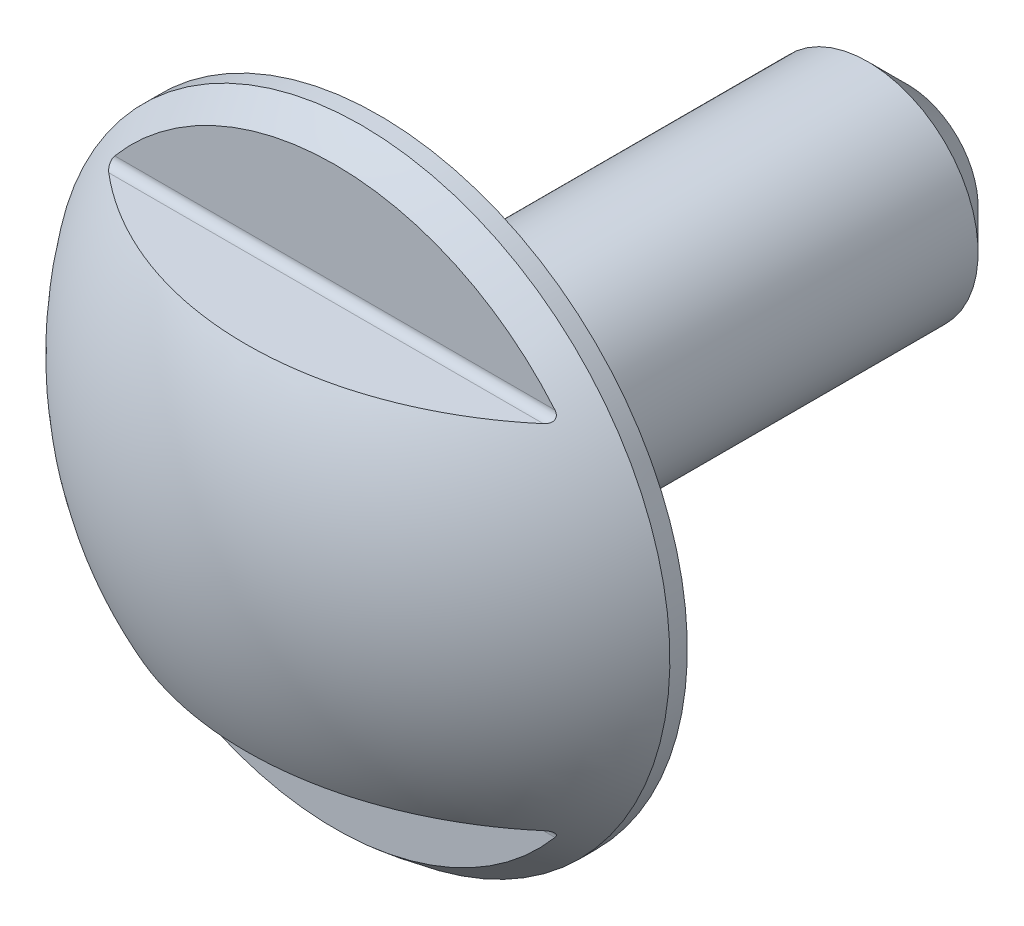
ISO-10303-21;
HEADER;
FILE_DESCRIPTION(('STEP AP214'),'2;1');
FILE_NAME('part.step','',(''),(''),'','','');
FILE_SCHEMA(('AUTOMOTIVE_DESIGN { 1 0 10303 214 1 1 1 1 }'));
ENDSEC;
DATA;
#1=APPLICATION_CONTEXT('core data for automotive mechanical design processes');
#2=APPLICATION_PROTOCOL_DEFINITION('international standard','automotive_design',2000,#1);
#3=PRODUCT_CONTEXT('',#1,'mechanical');
#4=PRODUCT('Part','Part','',(#3));
#5=PRODUCT_RELATED_PRODUCT_CATEGORY('part','',(#4));
#6=PRODUCT_DEFINITION_FORMATION('','',#4);
#7=PRODUCT_DEFINITION_CONTEXT('part definition',#1,'design');
#8=PRODUCT_DEFINITION('design','',#6,#7);
#9=PRODUCT_DEFINITION_SHAPE('','',#8);
#10=(LENGTH_UNIT() NAMED_UNIT(*) SI_UNIT(.MILLI.,.METRE.));
#11=(NAMED_UNIT(*) PLANE_ANGLE_UNIT() SI_UNIT($,.RADIAN.));
#12=(NAMED_UNIT(*) SI_UNIT($,.STERADIAN.) SOLID_ANGLE_UNIT());
#13=UNCERTAINTY_MEASURE_WITH_UNIT(LENGTH_MEASURE(1.E-05),#10,'distance_accuracy_value','');
#14=(GEOMETRIC_REPRESENTATION_CONTEXT(3) GLOBAL_UNCERTAINTY_ASSIGNED_CONTEXT((#13)) GLOBAL_UNIT_ASSIGNED_CONTEXT((#10,
#11,#12)) REPRESENTATION_CONTEXT('',''));
#15=CARTESIAN_POINT('',(0.,0.,0.));
#16=DIRECTION('',(0.,0.,1.));
#17=DIRECTION('',(1.,0.,0.));
#18=AXIS2_PLACEMENT_3D('',#15,#16,#17);
#19=CARTESIAN_POINT('',(0.,0.,-4.6));
#20=DIRECTION('',(0.,0.,-1.));
#21=DIRECTION('',(0.,1.,0.));
#22=AXIS2_PLACEMENT_3D('',#19,#20,#21);
#23=SPHERICAL_SURFACE('',#22,8.6);
#24=CARTESIAN_POINT('',(-4.93129589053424,4.00000010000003,1.2002));
#25=CARTESIAN_POINT('',(-4.94400869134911,4.00002755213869,1.18937440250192));
#26=CARTESIAN_POINT('',(-4.95653273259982,4.00086569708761,1.17807442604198));
#27=CARTESIAN_POINT('',(-4.98061859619,4.00484818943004,1.15455617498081));
#28=CARTESIAN_POINT('',(-4.99216373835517,4.00802596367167,1.14232691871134));
#29=CARTESIAN_POINT('',(-5.00824851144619,4.01517073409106,1.12327969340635));
#30=CARTESIAN_POINT('',(-5.01350134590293,4.01803673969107,1.11666550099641));
#31=CARTESIAN_POINT('',(-5.02325352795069,4.02472778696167,1.10338223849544));
#32=CARTESIAN_POINT('',(-5.02775470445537,4.02855044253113,1.09671334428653));
#33=CARTESIAN_POINT('',(-5.03581444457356,4.03733580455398,1.08335937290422));
#34=CARTESIAN_POINT('',(-5.03935808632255,4.04231453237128,1.07667551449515));
#35=CARTESIAN_POINT('',(-5.04506912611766,4.05341379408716,1.06367327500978));
#36=CARTESIAN_POINT('',(-5.04723943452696,4.05953187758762,1.05735414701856));
#37=CARTESIAN_POINT('',(-5.04972761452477,4.07179152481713,1.04631064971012));
#38=CARTESIAN_POINT('',(-5.05027001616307,4.07779874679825,1.04148821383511));
#39=CARTESIAN_POINT('',(-5.05008675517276,4.09031918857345,1.03258125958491));
#40=CARTESIAN_POINT('',(-5.04936142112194,4.09683227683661,1.02849655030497));
#41=CARTESIAN_POINT('',(-5.04692396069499,4.10910465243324,1.02173108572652));
#42=CARTESIAN_POINT('',(-5.04537374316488,4.11483286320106,1.01893202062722));
#43=CARTESIAN_POINT('',(-5.04152786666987,4.12630985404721,1.0139653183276));
#44=CARTESIAN_POINT('',(-5.03923189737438,4.1320586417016,1.01179794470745));
#45=CARTESIAN_POINT('',(-5.03276073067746,4.14622406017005,1.00715966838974));
#46=CARTESIAN_POINT('',(-5.02821352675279,4.15458782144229,1.00504797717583));
#47=CARTESIAN_POINT('',(-5.01813792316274,4.17091578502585,1.00195038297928));
#48=CARTESIAN_POINT('',(-5.01260774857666,4.1788792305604,1.00096654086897));
#49=CARTESIAN_POINT('',(-5.00321047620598,4.19122344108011,1.00013972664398));
#50=CARTESIAN_POINT('',(-4.99956818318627,4.19575786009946,0.99999715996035));
#51=CARTESIAN_POINT('',(-4.99583014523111,4.2002,1.0000001));
#52=B_SPLINE_CURVE_WITH_KNOTS('',3,(#24,#25,#26,#27,#28,#29,#30,#31,#32,#33,#34,#35,#36,#37,#38,
#39,#40,#41,#42,#43,#44,#45,#46,#47,#48,#49,#50,#51),.UNSPECIFIED.,.F.,.F.,(4,2,2,2,2,2,2,2,2,2,
2,2,2,4),(0.,0.0503367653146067,0.101407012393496,0.128096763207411,0.154720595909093,
0.181738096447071,0.208698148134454,0.231714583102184,0.2547250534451,0.274330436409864,
0.293943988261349,0.323032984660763,0.35217504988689,0.369605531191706),.UNSPECIFIED.);
#53=CARTESIAN_POINT('',(-4.93153120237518,4.,1.2));
#54=VERTEX_POINT('',#53);
#55=CARTESIAN_POINT('',(-4.99599839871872,4.2,1.));
#56=VERTEX_POINT('',#55);
#57=EDGE_CURVE('E65',#54,#56,#52,.T.);
#58=ORIENTED_EDGE('',*,*,#57,.T.);
#59=CARTESIAN_POINT('',(0.,0.,1.));
#60=DIRECTION('',(0.,0.,1.));
#61=DIRECTION('',(1.,0.,0.));
#62=AXIS2_PLACEMENT_3D('',#59,#60,#61);
#63=CIRCLE('',#62,6.52686754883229);
#64=CARTESIAN_POINT('',(4.99599839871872,4.2,1.));
#65=VERTEX_POINT('',#64);
#66=EDGE_CURVE('E53',#56,#65,#63,.F.);
#67=ORIENTED_EDGE('',*,*,#66,.T.);
#68=CARTESIAN_POINT('',(4.9958301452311,4.2002,1.00000010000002));
#69=CARTESIAN_POINT('',(5.00201722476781,4.19284644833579,0.99999628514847));
#70=CARTESIAN_POINT('',(5.00795600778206,4.18522194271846,1.00039174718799));
#71=CARTESIAN_POINT('',(5.01910433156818,4.16943558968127,1.00218645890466));
#72=CARTESIAN_POINT('',(5.0243041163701,4.16126833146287,1.00359786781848));
#73=CARTESIAN_POINT('',(5.03264013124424,4.1462693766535,1.00723142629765));
#74=CARTESIAN_POINT('',(5.03598102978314,4.13950102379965,1.00923230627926));
#75=CARTESIAN_POINT('',(5.04172228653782,4.12589879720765,1.01409436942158));
#76=CARTESIAN_POINT('',(5.0441263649,4.11906529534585,1.01695206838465));
#77=CARTESIAN_POINT('',(5.04782424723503,4.10543946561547,1.02360193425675));
#78=CARTESIAN_POINT('',(5.04910502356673,4.09864850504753,1.02740442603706));
#79=CARTESIAN_POINT('',(5.05036095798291,4.08547550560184,1.03585003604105));
#80=CARTESIAN_POINT('',(5.05033629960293,4.07909340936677,1.0404930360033));
#81=CARTESIAN_POINT('',(5.04909312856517,4.06795403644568,1.04964179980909));
#82=CARTESIAN_POINT('',(5.04806155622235,4.06309863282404,1.05405587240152));
#83=CARTESIAN_POINT('',(5.04516012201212,4.05396740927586,1.06319268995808));
#84=CARTESIAN_POINT('',(5.04329002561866,4.04969175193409,1.06791552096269));
#85=CARTESIAN_POINT('',(5.0380851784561,4.04042199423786,1.07915187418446));
#86=CARTESIAN_POINT('',(5.0344694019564,4.035669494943,1.08573369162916));
#87=CARTESIAN_POINT('',(5.02626946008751,4.027215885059,1.09896713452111));
#88=CARTESIAN_POINT('',(5.0216832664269,4.02351701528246,1.10561887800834));
#89=CARTESIAN_POINT('',(5.00927696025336,4.01540744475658,1.12222215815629));
#90=CARTESIAN_POINT('',(5.00100161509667,4.01159831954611,1.13212358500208));
#91=CARTESIAN_POINT('',(4.98342713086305,4.00569831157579,1.15152293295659));
#92=CARTESIAN_POINT('',(4.97412528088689,4.00361210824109,1.16101968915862));
#93=CARTESIAN_POINT('',(4.95912315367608,4.00144679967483,1.17542874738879));
#94=CARTESIAN_POINT('',(4.95364736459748,4.00088815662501,1.18051276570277));
#95=CARTESIAN_POINT('',(4.94256715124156,4.00016429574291,1.19048969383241));
#96=CARTESIAN_POINT('',(4.93696387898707,3.99999638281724,1.19538368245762));
#97=CARTESIAN_POINT('',(4.93129589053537,4.00000009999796,1.20020000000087));
#98=B_SPLINE_CURVE_WITH_KNOTS('',3,(#68,#69,#70,#71,#72,#73,#74,#75,#76,#77,#78,#79,#80,#81,#82,
#83,#84,#85,#86,#87,#88,#89,#90,#91,#92,#93,#94,#95,#96,#97),.UNSPECIFIED.,.F.,.F.,(4,2,2,2,2,2,
2,2,2,2,2,2,2,2,4),(0.,0.0288904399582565,0.0581325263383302,0.0814696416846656,
0.104713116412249,0.128222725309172,0.1517290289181,0.171566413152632,0.191409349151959,
0.217922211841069,0.244491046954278,0.284631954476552,0.324881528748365,0.347348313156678,
0.369659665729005),.UNSPECIFIED.);
#99=CARTESIAN_POINT('',(4.93153120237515,4.,1.2));
#100=VERTEX_POINT('',#99);
#101=EDGE_CURVE('E58',#65,#100,#98,.T.);
#102=ORIENTED_EDGE('',*,*,#101,.T.);
#103=CARTESIAN_POINT('',(0.,4.,-4.6));
#104=DIRECTION('',(0.,1.,0.));
#105=DIRECTION('',(0.,0.,1.));
#106=AXIS2_PLACEMENT_3D('',#103,#104,#105);
#107=CIRCLE('',#106,7.61314652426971);
#108=EDGE_CURVE('E70',#100,#54,#107,.F.);
#109=ORIENTED_EDGE('',*,*,#108,.T.);
#110=EDGE_LOOP('',(#58,#67,#102,#109));
#111=FACE_BOUND('',#110,.T.);
#112=CARTESIAN_POINT('',(0.,0.,0.395998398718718));
#113=DIRECTION('',(0.,0.,-1.));
#114=DIRECTION('',(-1.,0.,0.));
#115=AXIS2_PLACEMENT_3D('',#112,#113,#114);
#116=CIRCLE('',#115,7.);
#117=CARTESIAN_POINT('',(-7.,0.,0.395998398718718));
#118=VERTEX_POINT('',#117);
#119=EDGE_CURVE('E59',#118,#118,#116,.T.);
#120=ORIENTED_EDGE('',*,*,#119,.F.);
#121=EDGE_LOOP('',(#120));
#122=FACE_BOUND('',#121,.T.);
#123=CARTESIAN_POINT('',(4.93129589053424,-4.00000010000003,1.2002));
#124=CARTESIAN_POINT('',(4.94400869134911,-4.00002755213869,1.18937440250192));
#125=CARTESIAN_POINT('',(4.95653273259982,-4.00086569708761,1.17807442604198));
#126=CARTESIAN_POINT('',(4.98061859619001,-4.00484818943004,1.15455617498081));
#127=CARTESIAN_POINT('',(4.99216373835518,-4.00802596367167,1.14232691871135));
#128=CARTESIAN_POINT('',(5.00824851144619,-4.01517073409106,1.12327969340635));
#129=CARTESIAN_POINT('',(5.01350134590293,-4.01803673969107,1.11666550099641));
#130=CARTESIAN_POINT('',(5.02325352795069,-4.02472778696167,1.10338223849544));
#131=CARTESIAN_POINT('',(5.02775470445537,-4.02855044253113,1.09671334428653));
#132=CARTESIAN_POINT('',(5.03581444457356,-4.03733580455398,1.08335937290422));
#133=CARTESIAN_POINT('',(5.03935808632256,-4.04231453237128,1.07667551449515));
#134=CARTESIAN_POINT('',(5.04506912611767,-4.05341379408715,1.06367327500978));
#135=CARTESIAN_POINT('',(5.04723943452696,-4.05953187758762,1.05735414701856));
#136=CARTESIAN_POINT('',(5.04972761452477,-4.07179152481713,1.04631064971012));
#137=CARTESIAN_POINT('',(5.05027001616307,-4.07779874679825,1.04148821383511));
#138=CARTESIAN_POINT('',(5.05008675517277,-4.09031918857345,1.03258125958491));
#139=CARTESIAN_POINT('',(5.04936142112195,-4.09683227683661,1.02849655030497));
#140=CARTESIAN_POINT('',(5.046923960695,-4.10910465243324,1.02173108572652));
#141=CARTESIAN_POINT('',(5.04537374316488,-4.11483286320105,1.01893202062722));
#142=CARTESIAN_POINT('',(5.04152786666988,-4.12630985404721,1.0139653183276));
#143=CARTESIAN_POINT('',(5.03923189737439,-4.1320586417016,1.01179794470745));
#144=CARTESIAN_POINT('',(5.03276073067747,-4.14622406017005,1.00715966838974));
#145=CARTESIAN_POINT('',(5.0282135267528,-4.15458782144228,1.00504797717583));
#146=CARTESIAN_POINT('',(5.01813792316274,-4.17091578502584,1.00195038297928));
#147=CARTESIAN_POINT('',(5.01260774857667,-4.17887923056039,1.00096654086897));
#148=CARTESIAN_POINT('',(5.00321047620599,-4.19122344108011,1.00013972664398));
#149=CARTESIAN_POINT('',(4.99956818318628,-4.19575786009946,0.999997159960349));
#150=CARTESIAN_POINT('',(4.99583014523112,-4.2002,1.0000001));
#151=B_SPLINE_CURVE_WITH_KNOTS('',3,(#123,#124,#125,#126,#127,#128,#129,#130,#131,#132,#133,
#134,#135,#136,#137,#138,#139,#140,#141,#142,#143,#144,#145,#146,#147,#148,#149,#150),
.UNSPECIFIED.,.F.,.F.,(4,2,2,2,2,2,2,2,2,2,2,2,2,4),(0.,0.0503367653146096,0.101407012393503,
0.128096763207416,0.154720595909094,0.181738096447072,0.208698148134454,0.231714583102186,
0.254725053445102,0.274330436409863,0.293943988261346,0.323032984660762,0.352175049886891,
0.369605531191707),.UNSPECIFIED.);
#152=CARTESIAN_POINT('',(4.93153120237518,-4.,1.2));
#153=VERTEX_POINT('',#152);
#154=CARTESIAN_POINT('',(4.99599839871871,-4.2,1.));
#155=VERTEX_POINT('',#154);
#156=EDGE_CURVE('E116',#153,#155,#151,.T.);
#157=ORIENTED_EDGE('',*,*,#156,.T.);
#158=CARTESIAN_POINT('',(0.,0.,1.));
#159=DIRECTION('',(0.,0.,1.));
#160=DIRECTION('',(1.,0.,0.));
#161=AXIS2_PLACEMENT_3D('',#158,#159,#160);
#162=CIRCLE('',#161,6.52686754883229);
#163=CARTESIAN_POINT('',(-4.99599839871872,-4.2,1.));
#164=VERTEX_POINT('',#163);
#165=EDGE_CURVE('E123',#155,#164,#162,.F.);
#166=ORIENTED_EDGE('',*,*,#165,.T.);
#167=CARTESIAN_POINT('',(-4.9958301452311,-4.2002,1.00000010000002));
#168=CARTESIAN_POINT('',(-5.00201722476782,-4.19284644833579,0.999996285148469));
#169=CARTESIAN_POINT('',(-5.00795600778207,-4.18522194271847,1.00039174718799));
#170=CARTESIAN_POINT('',(-5.01910433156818,-4.16943558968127,1.00218645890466));
#171=CARTESIAN_POINT('',(-5.0243041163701,-4.16126833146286,1.00359786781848));
#172=CARTESIAN_POINT('',(-5.03264013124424,-4.1462693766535,1.00723142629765));
#173=CARTESIAN_POINT('',(-5.03598102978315,-4.13950102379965,1.00923230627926));
#174=CARTESIAN_POINT('',(-5.04172228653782,-4.12589879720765,1.01409436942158));
#175=CARTESIAN_POINT('',(-5.0441263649,-4.11906529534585,1.01695206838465));
#176=CARTESIAN_POINT('',(-5.04782424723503,-4.10543946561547,1.02360193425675));
#177=CARTESIAN_POINT('',(-5.04910502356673,-4.09864850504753,1.02740442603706));
#178=CARTESIAN_POINT('',(-5.05036095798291,-4.08547550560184,1.03585003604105));
#179=CARTESIAN_POINT('',(-5.05033629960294,-4.07909340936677,1.0404930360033));
#180=CARTESIAN_POINT('',(-5.04909312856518,-4.06795403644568,1.04964179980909));
#181=CARTESIAN_POINT('',(-5.04806155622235,-4.06309863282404,1.05405587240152));
#182=CARTESIAN_POINT('',(-5.04516012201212,-4.05396740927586,1.06319268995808));
#183=CARTESIAN_POINT('',(-5.04329002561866,-4.04969175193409,1.06791552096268));
#184=CARTESIAN_POINT('',(-5.0380851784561,-4.04042199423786,1.07915187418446));
#185=CARTESIAN_POINT('',(-5.03446940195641,-4.035669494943,1.08573369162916));
#186=CARTESIAN_POINT('',(-5.02626946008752,-4.027215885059,1.09896713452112));
#187=CARTESIAN_POINT('',(-5.02168326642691,-4.02351701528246,1.10561887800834));
#188=CARTESIAN_POINT('',(-5.00927696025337,-4.01540744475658,1.12222215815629));
#189=CARTESIAN_POINT('',(-5.00100161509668,-4.01159831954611,1.13212358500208));
#190=CARTESIAN_POINT('',(-4.98342713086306,-4.00569831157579,1.15152293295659));
#191=CARTESIAN_POINT('',(-4.97412528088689,-4.00361210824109,1.16101968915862));
#192=CARTESIAN_POINT('',(-4.95912315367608,-4.00144679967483,1.17542874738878));
#193=CARTESIAN_POINT('',(-4.95364736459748,-4.00088815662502,1.18051276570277));
#194=CARTESIAN_POINT('',(-4.94256715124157,-4.00016429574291,1.19048969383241));
#195=CARTESIAN_POINT('',(-4.93696387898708,-3.99999638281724,1.19538368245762));
#196=CARTESIAN_POINT('',(-4.93129589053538,-4.00000009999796,1.20020000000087));
#197=B_SPLINE_CURVE_WITH_KNOTS('',3,(#167,#168,#169,#170,#171,#172,#173,#174,#175,#176,#177,
#178,#179,#180,#181,#182,#183,#184,#185,#186,#187,#188,#189,#190,#191,#192,#193,#194,#195,#196),
.UNSPECIFIED.,.F.,.F.,(4,2,2,2,2,2,2,2,2,2,2,2,2,2,4),(0.,0.02889043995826,0.0581325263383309,
0.0814696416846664,0.10471311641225,0.128222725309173,0.151729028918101,0.171566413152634,
0.191409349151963,0.217922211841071,0.244491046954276,0.284631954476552,0.324881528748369,
0.347348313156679,0.369659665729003),.UNSPECIFIED.);
#198=CARTESIAN_POINT('',(-4.93153120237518,-4.,1.2));
#199=VERTEX_POINT('',#198);
#200=EDGE_CURVE('E110',#164,#199,#197,.T.);
#201=ORIENTED_EDGE('',*,*,#200,.T.);
#202=CARTESIAN_POINT('',(0.,-4.,-4.6));
#203=DIRECTION('',(0.,-1.,0.));
#204=DIRECTION('',(0.,0.,-1.));
#205=AXIS2_PLACEMENT_3D('',#202,#203,#204);
#206=CIRCLE('',#205,7.61314652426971);
#207=EDGE_CURVE('E72',#199,#153,#206,.F.);
#208=ORIENTED_EDGE('',*,*,#207,.T.);
#209=EDGE_LOOP('',(#157,#166,#201,#208));
#210=FACE_BOUND('',#209,.T.);
#211=ADVANCED_FACE('F14',(#111,#122,#210),#23,.T.);
#212=CARTESIAN_POINT('',(0.,0.,-10.));
#213=DIRECTION('',(0.,0.,-1.));
#214=DIRECTION('',(-1.,0.,0.));
#215=AXIS2_PLACEMENT_3D('',#212,#213,#214);
#216=CYLINDRICAL_SURFACE('',#215,7.);
#217=CARTESIAN_POINT('',(0.,0.,0.));
#218=DIRECTION('',(0.,0.,-1.));
#219=DIRECTION('',(-1.,0.,0.));
#220=AXIS2_PLACEMENT_3D('',#217,#218,#219);
#221=CIRCLE('',#220,7.);
#222=CARTESIAN_POINT('',(-7.,0.,0.));
#223=VERTEX_POINT('',#222);
#224=EDGE_CURVE('E194',#223,#223,#221,.T.);
#225=ORIENTED_EDGE('',*,*,#224,.F.);
#226=EDGE_LOOP('',(#225));
#227=FACE_BOUND('',#226,.T.);
#228=ORIENTED_EDGE('',*,*,#119,.T.);
#229=EDGE_LOOP('',(#228));
#230=FACE_BOUND('',#229,.T.);
#231=ADVANCED_FACE('F137',(#227,#230),#216,.T.);
#232=CARTESIAN_POINT('',(0.,7.,0.));
#233=DIRECTION('',(0.,0.,1.));
#234=DIRECTION('',(1.,0.,0.));
#235=AXIS2_PLACEMENT_3D('',#232,#233,#234);
#236=PLANE('',#235);
#237=CARTESIAN_POINT('',(0.,0.,0.));
#238=DIRECTION('',(0.,0.,-1.));
#239=DIRECTION('',(-1.,0.,0.));
#240=AXIS2_PLACEMENT_3D('',#237,#238,#239);
#241=CIRCLE('',#240,2.25);
#242=CARTESIAN_POINT('',(-2.25,0.,0.));
#243=VERTEX_POINT('',#242);
#244=EDGE_CURVE('E191',#243,#243,#241,.T.);
#245=ORIENTED_EDGE('',*,*,#244,.F.);
#246=EDGE_LOOP('',(#245));
#247=FACE_BOUND('',#246,.T.);
#248=ORIENTED_EDGE('',*,*,#224,.T.);
#249=EDGE_LOOP('',(#248));
#250=FACE_BOUND('',#249,.T.);
#251=ADVANCED_FACE('F141',(#247,#250),#236,.F.);
#252=CARTESIAN_POINT('',(0.,0.,-0.4));
#253=DIRECTION('',(0.,0.,-1.));
#254=DIRECTION('',(-1.,0.,0.));
#255=AXIS2_PLACEMENT_3D('',#252,#253,#254);
#256=TOROIDAL_SURFACE('',#255,2.25,0.4);
#257=CARTESIAN_POINT('',(0.,0.,-0.4));
#258=DIRECTION('',(0.,0.,-1.));
#259=DIRECTION('',(-1.,0.,0.));
#260=AXIS2_PLACEMENT_3D('',#257,#258,#259);
#261=CIRCLE('',#260,1.85);
#262=CARTESIAN_POINT('',(-1.85,0.,-0.4));
#263=VERTEX_POINT('',#262);
#264=EDGE_CURVE('E188',#263,#263,#261,.T.);
#265=ORIENTED_EDGE('',*,*,#264,.F.);
#266=EDGE_LOOP('',(#265));
#267=FACE_BOUND('',#266,.T.);
#268=ORIENTED_EDGE('',*,*,#244,.T.);
#269=EDGE_LOOP('',(#268));
#270=FACE_BOUND('',#269,.T.);
#271=ADVANCED_FACE('F146',(#267,#270),#256,.F.);
#272=CARTESIAN_POINT('',(0.,0.,-10.));
#273=DIRECTION('',(0.,0.,-1.));
#274=DIRECTION('',(-1.,0.,0.));
#275=AXIS2_PLACEMENT_3D('',#272,#273,#274);
#276=CYLINDRICAL_SURFACE('',#275,1.85);
#277=CARTESIAN_POINT('',(0.,0.,-0.46698729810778));
#278=DIRECTION('',(0.,0.,-1.));
#279=DIRECTION('',(-1.,0.,0.));
#280=AXIS2_PLACEMENT_3D('',#277,#278,#279);
#281=CIRCLE('',#280,1.85);
#282=CARTESIAN_POINT('',(-1.85,0.,-0.46698729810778));
#283=VERTEX_POINT('',#282);
#284=EDGE_CURVE('E180',#283,#283,#281,.T.);
#285=ORIENTED_EDGE('',*,*,#284,.F.);
#286=EDGE_LOOP('',(#285));
#287=FACE_BOUND('',#286,.T.);
#288=ORIENTED_EDGE('',*,*,#264,.T.);
#289=EDGE_LOOP('',(#288));
#290=FACE_BOUND('',#289,.T.);
#291=ADVANCED_FACE('F154',(#287,#290),#276,.T.);
#292=CARTESIAN_POINT('',(0.,0.,-0.466987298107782));
#293=DIRECTION('',(0.,0.,-1.));
#294=DIRECTION('',(-1.,0.,0.));
#295=AXIS2_PLACEMENT_3D('',#292,#293,#294);
#296=TOROIDAL_SURFACE('',#295,2.25,0.399999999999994);
#297=CARTESIAN_POINT('',(0.,0.,-0.666987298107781));
#298=DIRECTION('',(0.,0.,-1.));
#299=DIRECTION('',(-1.,0.,0.));
#300=AXIS2_PLACEMENT_3D('',#297,#298,#299);
#301=CIRCLE('',#300,1.90358983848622);
#302=CARTESIAN_POINT('',(-1.90358983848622,0.,-0.666987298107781));
#303=VERTEX_POINT('',#302);
#304=EDGE_CURVE('E176',#303,#303,#301,.T.);
#305=ORIENTED_EDGE('',*,*,#304,.F.);
#306=EDGE_LOOP('',(#305));
#307=FACE_BOUND('',#306,.T.);
#308=ORIENTED_EDGE('',*,*,#284,.T.);
#309=EDGE_LOOP('',(#308));
#310=FACE_BOUND('',#309,.T.);
#311=ADVANCED_FACE('F158',(#307,#310),#296,.F.);
#312=CARTESIAN_POINT('',(0.,0.,-0.666987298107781));
#313=DIRECTION('',(0.,0.,-1.));
#314=DIRECTION('',(-1.,0.,0.));
#315=AXIS2_PLACEMENT_3D('',#312,#313,#314);
#316=CONICAL_SURFACE('',#315,1.90358983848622,0.523598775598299);
#317=CARTESIAN_POINT('',(0.,0.,-1.7));
#318=DIRECTION('',(0.,0.,-1.));
#319=DIRECTION('',(-1.,0.,0.));
#320=AXIS2_PLACEMENT_3D('',#317,#318,#319);
#321=CIRCLE('',#320,2.5);
#322=CARTESIAN_POINT('',(-2.5,0.,-1.7));
#323=VERTEX_POINT('',#322);
#324=EDGE_CURVE('E175',#323,#323,#321,.T.);
#325=ORIENTED_EDGE('',*,*,#324,.F.);
#326=EDGE_LOOP('',(#325));
#327=FACE_BOUND('',#326,.T.);
#328=ORIENTED_EDGE('',*,*,#304,.T.);
#329=EDGE_LOOP('',(#328));
#330=FACE_BOUND('',#329,.T.);
#331=ADVANCED_FACE('F162',(#327,#330),#316,.T.);
#332=CARTESIAN_POINT('',(0.,0.,-10.));
#333=DIRECTION('',(0.,0.,-1.));
#334=DIRECTION('',(-1.,0.,0.));
#335=AXIS2_PLACEMENT_3D('',#332,#333,#334);
#336=CYLINDRICAL_SURFACE('',#335,2.5);
#337=CARTESIAN_POINT('',(0.,0.,-11.1));
#338=DIRECTION('',(0.,0.,-1.));
#339=DIRECTION('',(-1.,0.,0.));
#340=AXIS2_PLACEMENT_3D('',#337,#338,#339);
#341=CIRCLE('',#340,2.5);
#342=CARTESIAN_POINT('',(-2.5,0.,-11.1));
#343=VERTEX_POINT('',#342);
#344=EDGE_CURVE('E9',#343,#343,#341,.F.);
#345=ORIENTED_EDGE('',*,*,#344,.T.);
#346=EDGE_LOOP('',(#345));
#347=FACE_BOUND('',#346,.T.);
#348=ORIENTED_EDGE('',*,*,#324,.T.);
#349=EDGE_LOOP('',(#348));
#350=FACE_BOUND('',#349,.T.);
#351=ADVANCED_FACE('F165',(#347,#350),#336,.T.);
#352=CARTESIAN_POINT('',(9.,4.2,1.));
#353=DIRECTION('',(0.,0.,1.));
#354=DIRECTION('',(1.,0.,0.));
#355=AXIS2_PLACEMENT_3D('',#352,#353,#354);
#356=PLANE('',#355);
#357=DIRECTION('',(-1.,0.,0.));
#358=VECTOR('',#357,1.);
#359=CARTESIAN_POINT('',(9.,4.2,1.));
#360=LINE('',#359,#358);
#361=EDGE_CURVE('E35',#65,#56,#360,.T.);
#362=ORIENTED_EDGE('',*,*,#361,.F.);
#363=ORIENTED_EDGE('',*,*,#66,.F.);
#364=EDGE_LOOP('',(#362,#363));
#365=FACE_BOUND('',#364,.T.);
#366=ADVANCED_FACE('F54',(#365),#356,.T.);
#367=CARTESIAN_POINT('',(9.,4.2,1.2));
#368=DIRECTION('',(-1.,0.,0.));
#369=DIRECTION('',(0.,-1.,0.));
#370=AXIS2_PLACEMENT_3D('',#367,#368,#369);
#371=CYLINDRICAL_SURFACE('',#370,0.2);
#372=DIRECTION('',(-1.,0.,0.));
#373=VECTOR('',#372,1.);
#374=CARTESIAN_POINT('',(9.,4.,1.2));
#375=LINE('',#374,#373);
#376=EDGE_CURVE('E67',#100,#54,#375,.T.);
#377=ORIENTED_EDGE('',*,*,#376,.F.);
#378=ORIENTED_EDGE('',*,*,#101,.F.);
#379=ORIENTED_EDGE('',*,*,#361,.T.);
#380=ORIENTED_EDGE('',*,*,#57,.F.);
#381=EDGE_LOOP('',(#377,#378,#379,#380));
#382=FACE_BOUND('',#381,.T.);
#383=ADVANCED_FACE('F64',(#382),#371,.F.);
#384=CARTESIAN_POINT('',(9.,4.,4.));
#385=DIRECTION('',(0.,1.,0.));
#386=DIRECTION('',(0.,0.,1.));
#387=AXIS2_PLACEMENT_3D('',#384,#385,#386);
#388=PLANE('',#387);
#389=ORIENTED_EDGE('',*,*,#108,.F.);
#390=ORIENTED_EDGE('',*,*,#376,.T.);
#391=EDGE_LOOP('',(#389,#390));
#392=FACE_BOUND('',#391,.T.);
#393=ADVANCED_FACE('F91',(#392),#388,.T.);
#394=CARTESIAN_POINT('',(9.,-12.,1.));
#395=DIRECTION('',(0.,0.,1.));
#396=DIRECTION('',(1.,0.,0.));
#397=AXIS2_PLACEMENT_3D('',#394,#395,#396);
#398=PLANE('',#397);
#399=DIRECTION('',(-1.,0.,0.));
#400=VECTOR('',#399,1.);
#401=CARTESIAN_POINT('',(9.,-4.2,1.));
#402=LINE('',#401,#400);
#403=EDGE_CURVE('E177',#155,#164,#402,.T.);
#404=ORIENTED_EDGE('',*,*,#403,.T.);
#405=ORIENTED_EDGE('',*,*,#165,.F.);
#406=EDGE_LOOP('',(#404,#405));
#407=FACE_BOUND('',#406,.T.);
#408=ADVANCED_FACE('F96',(#407),#398,.T.);
#409=CARTESIAN_POINT('',(9.,-4.2,1.2));
#410=DIRECTION('',(-1.,0.,0.));
#411=DIRECTION('',(0.,-1.,0.));
#412=AXIS2_PLACEMENT_3D('',#409,#410,#411);
#413=CYLINDRICAL_SURFACE('',#412,0.2);
#414=DIRECTION('',(-1.,0.,0.));
#415=VECTOR('',#414,1.);
#416=CARTESIAN_POINT('',(9.,-4.,1.2));
#417=LINE('',#416,#415);
#418=EDGE_CURVE('E28',#153,#199,#417,.T.);
#419=ORIENTED_EDGE('',*,*,#418,.T.);
#420=ORIENTED_EDGE('',*,*,#200,.F.);
#421=ORIENTED_EDGE('',*,*,#403,.F.);
#422=ORIENTED_EDGE('',*,*,#156,.F.);
#423=EDGE_LOOP('',(#419,#420,#421,#422));
#424=FACE_BOUND('',#423,.T.);
#425=ADVANCED_FACE('F102',(#424),#413,.F.);
#426=CARTESIAN_POINT('',(9.,-4.,1.2));
#427=DIRECTION('',(0.,-1.,0.));
#428=DIRECTION('',(0.,0.,-1.));
#429=AXIS2_PLACEMENT_3D('',#426,#427,#428);
#430=PLANE('',#429);
#431=ORIENTED_EDGE('',*,*,#418,.F.);
#432=ORIENTED_EDGE('',*,*,#207,.F.);
#433=EDGE_LOOP('',(#431,#432));
#434=FACE_BOUND('',#433,.T.);
#435=ADVANCED_FACE('F98',(#434),#430,.T.);
#436=CARTESIAN_POINT('',(0.,0.,-12.));
#437=DIRECTION('',(0.,0.,-1.));
#438=DIRECTION('',(-1.,0.,0.));
#439=AXIS2_PLACEMENT_3D('',#436,#437,#438);
#440=PLANE('',#439);
#441=CARTESIAN_POINT('',(0.,0.,-12.));
#442=DIRECTION('',(0.,0.,-1.));
#443=DIRECTION('',(-1.,0.,0.));
#444=AXIS2_PLACEMENT_3D('',#441,#442,#443);
#445=CIRCLE('',#444,1.6);
#446=CARTESIAN_POINT('',(-1.6,0.,-12.));
#447=VERTEX_POINT('',#446);
#448=EDGE_CURVE('E22',#447,#447,#445,.T.);
#449=ORIENTED_EDGE('',*,*,#448,.T.);
#450=EDGE_LOOP('',(#449));
#451=FACE_BOUND('',#450,.T.);
#452=ADVANCED_FACE('F101',(#451),#440,.T.);
#453=CARTESIAN_POINT('',(0.,0.,-12.));
#454=DIRECTION('',(0.,0.,1.));
#455=DIRECTION('',(1.,0.,0.));
#456=AXIS2_PLACEMENT_3D('',#453,#454,#455);
#457=CONICAL_SURFACE('',#456,1.6,0.785398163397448);
#458=ORIENTED_EDGE('',*,*,#344,.F.);
#459=EDGE_LOOP('',(#458));
#460=FACE_BOUND('',#459,.T.);
#461=ORIENTED_EDGE('',*,*,#448,.F.);
#462=EDGE_LOOP('',(#461));
#463=FACE_BOUND('',#462,.T.);
#464=ADVANCED_FACE('F16',(#460,#463),#457,.T.);
#465=CLOSED_SHELL('',(#211,#231,#251,#271,#291,#311,#331,#351,#366,#383,#393,#408,#425,#435,
#452,#464));
#466=MANIFOLD_SOLID_BREP('B1',#465);
#467=ADVANCED_BREP_SHAPE_REPRESENTATION('',(#18,#466),#14);
#468=SHAPE_DEFINITION_REPRESENTATION(#9,#467);
ENDSEC;
END-ISO-10303-21;
